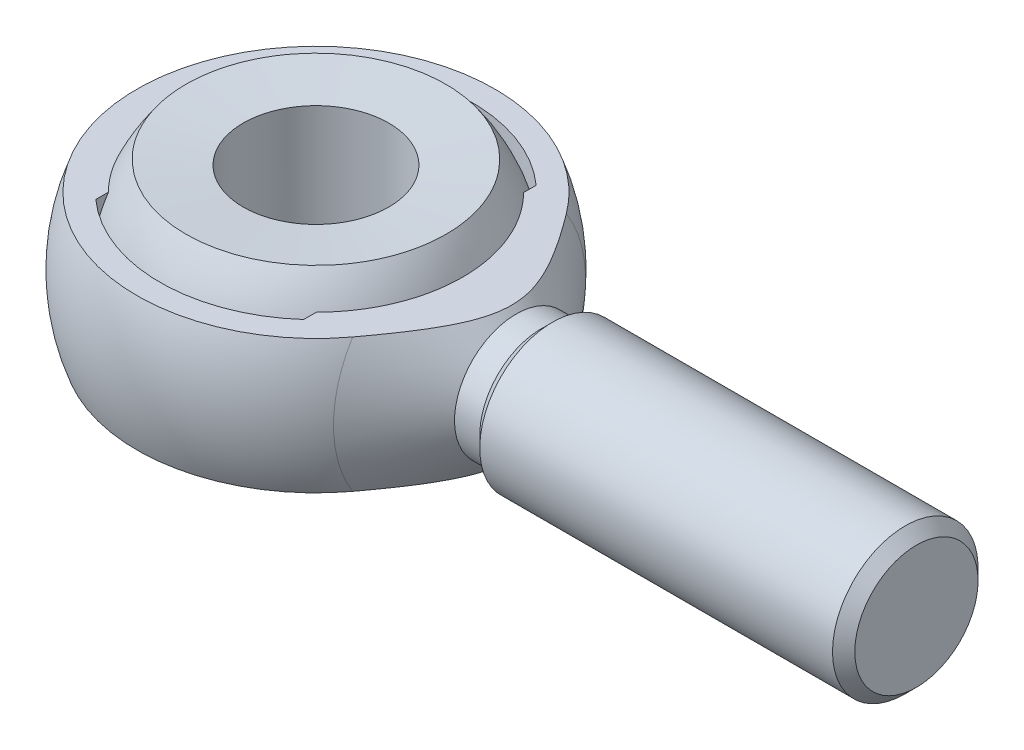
ISO-10303-21;
HEADER;
FILE_DESCRIPTION(('STEP AP214'),'2;1');
FILE_NAME('part.step','',(''),(''),'','','');
FILE_SCHEMA(('AUTOMOTIVE_DESIGN { 1 0 10303 214 1 1 1 1 }'));
ENDSEC;
DATA;
#1=APPLICATION_CONTEXT('core data for automotive mechanical design processes');
#2=APPLICATION_PROTOCOL_DEFINITION('international standard','automotive_design',2000,#1);
#3=PRODUCT_CONTEXT('',#1,'mechanical');
#4=PRODUCT('Part','Part','',(#3));
#5=PRODUCT_RELATED_PRODUCT_CATEGORY('part','',(#4));
#6=PRODUCT_DEFINITION_FORMATION('','',#4);
#7=PRODUCT_DEFINITION_CONTEXT('part definition',#1,'design');
#8=PRODUCT_DEFINITION('design','',#6,#7);
#9=PRODUCT_DEFINITION_SHAPE('','',#8);
#10=(LENGTH_UNIT() NAMED_UNIT(*) SI_UNIT(.MILLI.,.METRE.));
#11=(NAMED_UNIT(*) PLANE_ANGLE_UNIT() SI_UNIT($,.RADIAN.));
#12=(NAMED_UNIT(*) SI_UNIT($,.STERADIAN.) SOLID_ANGLE_UNIT());
#13=UNCERTAINTY_MEASURE_WITH_UNIT(LENGTH_MEASURE(1.E-05),#10,'distance_accuracy_value','');
#14=(GEOMETRIC_REPRESENTATION_CONTEXT(3) GLOBAL_UNCERTAINTY_ASSIGNED_CONTEXT((#13)) GLOBAL_UNIT_ASSIGNED_CONTEXT((#10,
#11,#12)) REPRESENTATION_CONTEXT('',''));
#15=CARTESIAN_POINT('',(0.,0.,0.));
#16=DIRECTION('',(0.,0.,1.));
#17=DIRECTION('',(1.,0.,0.));
#18=AXIS2_PLACEMENT_3D('',#15,#16,#17);
#19=CARTESIAN_POINT('',(0.,-11.0498662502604,0.));
#20=DIRECTION('',(0.,-1.,0.));
#21=DIRECTION('',(0.,0.,-1.));
#22=AXIS2_PLACEMENT_3D('',#19,#20,#21);
#23=CYLINDRICAL_SURFACE('',#22,7.999);
#24=CARTESIAN_POINT('',(0.,-9.95013374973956,0.));
#25=DIRECTION('',(0.,-1.,0.));
#26=DIRECTION('',(0.,0.,-1.));
#27=AXIS2_PLACEMENT_3D('',#24,#25,#26);
#28=CIRCLE('',#27,7.999);
#29=CARTESIAN_POINT('',(0.,-9.95013374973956,-7.999));
#30=VERTEX_POINT('',#29);
#31=EDGE_CURVE('E20',#30,#30,#28,.T.);
#32=ORIENTED_EDGE('',*,*,#31,.T.);
#33=EDGE_LOOP('',(#32));
#34=FACE_BOUND('',#33,.T.);
#35=CARTESIAN_POINT('',(0.,9.95013374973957,0.));
#36=DIRECTION('',(0.,-1.,0.));
#37=DIRECTION('',(0.,0.,-1.));
#38=AXIS2_PLACEMENT_3D('',#35,#36,#37);
#39=CIRCLE('',#38,7.999);
#40=CARTESIAN_POINT('',(0.,9.95013374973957,-7.999));
#41=VERTEX_POINT('',#40);
#42=EDGE_CURVE('E155',#41,#41,#39,.F.);
#43=ORIENTED_EDGE('',*,*,#42,.T.);
#44=EDGE_LOOP('',(#43));
#45=FACE_BOUND('',#44,.T.);
#46=ADVANCED_FACE('F16',(#34,#45),#23,.F.);
#47=CARTESIAN_POINT('',(8.,-9.95013374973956,0.));
#48=DIRECTION('',(0.,1.,0.));
#49=DIRECTION('',(0.,0.,1.));
#50=AXIS2_PLACEMENT_3D('',#47,#48,#49);
#51=PLANE('',#50);
#52=ORIENTED_EDGE('',*,*,#31,.F.);
#53=EDGE_LOOP('',(#52));
#54=FACE_BOUND('',#53,.T.);
#55=CARTESIAN_POINT('',(0.,-9.95013374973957,0.));
#56=DIRECTION('',(0.,-1.,0.));
#57=DIRECTION('',(0.,0.,-1.));
#58=AXIS2_PLACEMENT_3D('',#55,#56,#57);
#59=CIRCLE('',#58,8.);
#60=CARTESIAN_POINT('',(0.,-9.95013374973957,-8.));
#61=VERTEX_POINT('',#60);
#62=EDGE_CURVE('E153',#61,#61,#59,.T.);
#63=ORIENTED_EDGE('',*,*,#62,.T.);
#64=EDGE_LOOP('',(#63));
#65=FACE_BOUND('',#64,.T.);
#66=ADVANCED_FACE('F163',(#54,#65),#51,.F.);
#67=CARTESIAN_POINT('',(0.,9.95013374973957,0.));
#68=DIRECTION('',(0.,-1.,0.));
#69=DIRECTION('',(0.,0.,-1.));
#70=AXIS2_PLACEMENT_3D('',#67,#68,#69);
#71=PLANE('',#70);
#72=CARTESIAN_POINT('',(0.,9.95013374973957,0.));
#73=DIRECTION('',(0.,1.,0.));
#74=DIRECTION('',(0.,0.,1.));
#75=AXIS2_PLACEMENT_3D('',#72,#73,#74);
#76=CIRCLE('',#75,8.);
#77=CARTESIAN_POINT('',(0.,9.95013374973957,8.));
#78=VERTEX_POINT('',#77);
#79=EDGE_CURVE('E128',#78,#78,#76,.T.);
#80=ORIENTED_EDGE('',*,*,#79,.T.);
#81=EDGE_LOOP('',(#80));
#82=FACE_BOUND('',#81,.T.);
#83=ORIENTED_EDGE('',*,*,#42,.F.);
#84=EDGE_LOOP('',(#83));
#85=FACE_BOUND('',#84,.T.);
#86=ADVANCED_FACE('F166',(#82,#85),#71,.F.);
#87=CARTESIAN_POINT('',(0.,-10.5,0.));
#88=DIRECTION('',(0.,-1.,0.));
#89=DIRECTION('',(0.,0.,-1.));
#90=AXIS2_PLACEMENT_3D('',#87,#88,#89);
#91=CONICAL_SURFACE('',#90,14.285,1.48352986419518);
#92=ORIENTED_EDGE('',*,*,#62,.F.);
#93=EDGE_LOOP('',(#92));
#94=FACE_BOUND('',#93,.T.);
#95=CARTESIAN_POINT('',(0.,-10.5,0.));
#96=DIRECTION('',(0.,-1.,0.));
#97=DIRECTION('',(0.,0.,-1.));
#98=AXIS2_PLACEMENT_3D('',#95,#96,#97);
#99=CIRCLE('',#98,14.285);
#100=CARTESIAN_POINT('',(0.,-10.5,-14.285));
#101=VERTEX_POINT('',#100);
#102=EDGE_CURVE('E143',#101,#101,#99,.F.);
#103=ORIENTED_EDGE('',*,*,#102,.F.);
#104=EDGE_LOOP('',(#103));
#105=FACE_BOUND('',#104,.T.);
#106=ADVANCED_FACE('F170',(#94,#105),#91,.F.);
#107=CARTESIAN_POINT('',(11.428,21.,-5.71399999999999));
#108=DIRECTION('',(-1.,0.,0.));
#109=DIRECTION('',(0.,0.,1.));
#110=AXIS2_PLACEMENT_3D('',#107,#108,#109);
#111=PLANE('',#110);
#112=DIRECTION('',(0.,0.,1.));
#113=VECTOR('',#112,1.);
#114=CARTESIAN_POINT('',(11.428,-7.35,-5.71399999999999));
#115=LINE('',#114,#113);
#116=CARTESIAN_POINT('',(11.428,-7.35,-12.7768924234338));
#117=VERTEX_POINT('',#116);
#118=CARTESIAN_POINT('',(11.428,-7.35,-11.3881315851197));
#119=VERTEX_POINT('',#118);
#120=EDGE_CURVE('E133',#117,#119,#115,.T.);
#121=ORIENTED_EDGE('',*,*,#120,.T.);
#122=CARTESIAN_POINT('',(11.428,0.,0.));
#123=DIRECTION('',(-1.,0.,0.));
#124=DIRECTION('',(0.,0.,1.));
#125=AXIS2_PLACEMENT_3D('',#122,#123,#124);
#126=CIRCLE('',#125,13.5540415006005);
#127=CARTESIAN_POINT('',(11.428,-4.52361149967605,-12.7768924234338));
#128=VERTEX_POINT('',#127);
#129=EDGE_CURVE('E131',#128,#119,#126,.T.);
#130=ORIENTED_EDGE('',*,*,#129,.F.);
#131=DIRECTION('',(0.,1.,0.));
#132=VECTOR('',#131,1.);
#133=CARTESIAN_POINT('',(11.428,21.,-12.7768924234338));
#134=LINE('',#133,#132);
#135=EDGE_CURVE('E119',#128,#117,#134,.F.);
#136=ORIENTED_EDGE('',*,*,#135,.T.);
#137=EDGE_LOOP('',(#121,#130,#136));
#138=FACE_BOUND('',#137,.T.);
#139=ADVANCED_FACE('F132',(#138),#111,.T.);
#140=CARTESIAN_POINT('',(11.428,21.,12.7768924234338));
#141=DIRECTION('',(-1.,0.,0.));
#142=DIRECTION('',(0.,0.,1.));
#143=AXIS2_PLACEMENT_3D('',#140,#141,#142);
#144=PLANE('',#143);
#145=DIRECTION('',(0.,1.,0.));
#146=VECTOR('',#145,1.);
#147=CARTESIAN_POINT('',(11.428,21.,12.7768924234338));
#148=LINE('',#147,#146);
#149=CARTESIAN_POINT('',(11.428,-7.35,12.7768924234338));
#150=VERTEX_POINT('',#149);
#151=CARTESIAN_POINT('',(11.428,-4.523611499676,12.7768924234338));
#152=VERTEX_POINT('',#151);
#153=EDGE_CURVE('E146',#150,#152,#148,.T.);
#154=ORIENTED_EDGE('',*,*,#153,.T.);
#155=CARTESIAN_POINT('',(11.428,0.,0.));
#156=DIRECTION('',(-1.,0.,0.));
#157=DIRECTION('',(0.,0.,1.));
#158=AXIS2_PLACEMENT_3D('',#155,#156,#157);
#159=CIRCLE('',#158,13.5540415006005);
#160=CARTESIAN_POINT('',(11.428,-7.35,11.3881315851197));
#161=VERTEX_POINT('',#160);
#162=EDGE_CURVE('E137',#161,#152,#159,.T.);
#163=ORIENTED_EDGE('',*,*,#162,.F.);
#164=DIRECTION('',(0.,0.,1.));
#165=VECTOR('',#164,1.);
#166=CARTESIAN_POINT('',(11.428,-7.35,12.7768924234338));
#167=LINE('',#166,#165);
#168=EDGE_CURVE('E310',#161,#150,#167,.T.);
#169=ORIENTED_EDGE('',*,*,#168,.T.);
#170=EDGE_LOOP('',(#154,#163,#169));
#171=FACE_BOUND('',#170,.T.);
#172=ADVANCED_FACE('F309',(#171),#144,.T.);
#173=CARTESIAN_POINT('',(-11.428,21.,5.71399999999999));
#174=DIRECTION('',(1.,0.,0.));
#175=DIRECTION('',(0.,0.,-1.));
#176=AXIS2_PLACEMENT_3D('',#173,#174,#175);
#177=PLANE('',#176);
#178=DIRECTION('',(0.,0.,-1.));
#179=VECTOR('',#178,1.);
#180=CARTESIAN_POINT('',(-11.428,-7.35,5.71399999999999));
#181=LINE('',#180,#179);
#182=CARTESIAN_POINT('',(-11.428,-7.35,12.7768924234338));
#183=VERTEX_POINT('',#182);
#184=CARTESIAN_POINT('',(-11.428,-7.35,11.3881315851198));
#185=VERTEX_POINT('',#184);
#186=EDGE_CURVE('E330',#183,#185,#181,.T.);
#187=ORIENTED_EDGE('',*,*,#186,.T.);
#188=CARTESIAN_POINT('',(-11.428,0.,0.));
#189=DIRECTION('',(1.,0.,0.));
#190=DIRECTION('',(0.,0.,-1.));
#191=AXIS2_PLACEMENT_3D('',#188,#189,#190);
#192=CIRCLE('',#191,13.5540415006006);
#193=CARTESIAN_POINT('',(-11.428,-4.52361149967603,12.7768924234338));
#194=VERTEX_POINT('',#193);
#195=EDGE_CURVE('E300',#194,#185,#192,.T.);
#196=ORIENTED_EDGE('',*,*,#195,.F.);
#197=DIRECTION('',(0.,1.,0.));
#198=VECTOR('',#197,1.);
#199=CARTESIAN_POINT('',(-11.428,21.,12.7768924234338));
#200=LINE('',#199,#198);
#201=EDGE_CURVE('E312',#194,#183,#200,.F.);
#202=ORIENTED_EDGE('',*,*,#201,.T.);
#203=EDGE_LOOP('',(#187,#196,#202));
#204=FACE_BOUND('',#203,.T.);
#205=ADVANCED_FACE('F385',(#204),#177,.T.);
#206=CARTESIAN_POINT('',(-11.428,21.,-12.7768924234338));
#207=DIRECTION('',(1.,0.,0.));
#208=DIRECTION('',(0.,0.,-1.));
#209=AXIS2_PLACEMENT_3D('',#206,#207,#208);
#210=PLANE('',#209);
#211=DIRECTION('',(0.,1.,0.));
#212=VECTOR('',#211,1.);
#213=CARTESIAN_POINT('',(-11.428,21.,-12.7768924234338));
#214=LINE('',#213,#212);
#215=CARTESIAN_POINT('',(-11.428,-7.35,-12.7768924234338));
#216=VERTEX_POINT('',#215);
#217=CARTESIAN_POINT('',(-11.428,-4.52361149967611,-12.7768924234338));
#218=VERTEX_POINT('',#217);
#219=EDGE_CURVE('E113',#216,#218,#214,.T.);
#220=ORIENTED_EDGE('',*,*,#219,.T.);
#221=CARTESIAN_POINT('',(-11.428,0.,0.));
#222=DIRECTION('',(1.,0.,0.));
#223=DIRECTION('',(0.,0.,-1.));
#224=AXIS2_PLACEMENT_3D('',#221,#222,#223);
#225=CIRCLE('',#224,13.5540415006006);
#226=CARTESIAN_POINT('',(-11.428,-7.35,-11.3881315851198));
#227=VERTEX_POINT('',#226);
#228=EDGE_CURVE('E142',#227,#218,#225,.T.);
#229=ORIENTED_EDGE('',*,*,#228,.F.);
#230=DIRECTION('',(0.,0.,-1.));
#231=VECTOR('',#230,1.);
#232=CARTESIAN_POINT('',(-11.428,-7.35,-12.7768924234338));
#233=LINE('',#232,#231);
#234=EDGE_CURVE('E328',#227,#216,#233,.T.);
#235=ORIENTED_EDGE('',*,*,#234,.T.);
#236=EDGE_LOOP('',(#220,#229,#235));
#237=FACE_BOUND('',#236,.T.);
#238=ADVANCED_FACE('F378',(#237),#210,.T.);
#239=CARTESIAN_POINT('',(11.428,21.,12.7768924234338));
#240=DIRECTION('',(-1.,0.,0.));
#241=DIRECTION('',(0.,0.,1.));
#242=AXIS2_PLACEMENT_3D('',#239,#240,#241);
#243=PLANE('',#242);
#244=DIRECTION('',(0.,0.,1.));
#245=VECTOR('',#244,1.);
#246=CARTESIAN_POINT('',(11.428,7.35,12.7768924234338));
#247=LINE('',#246,#245);
#248=CARTESIAN_POINT('',(11.428,7.35,12.7768924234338));
#249=VERTEX_POINT('',#248);
#250=CARTESIAN_POINT('',(11.428,7.35,11.3881315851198));
#251=VERTEX_POINT('',#250);
#252=EDGE_CURVE('E326',#249,#251,#247,.F.);
#253=ORIENTED_EDGE('',*,*,#252,.T.);
#254=CARTESIAN_POINT('',(11.428,0.,0.));
#255=DIRECTION('',(-1.,0.,0.));
#256=DIRECTION('',(0.,0.,1.));
#257=AXIS2_PLACEMENT_3D('',#254,#255,#256);
#258=CIRCLE('',#257,13.5540415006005);
#259=CARTESIAN_POINT('',(11.428,4.52361149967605,12.7768924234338));
#260=VERTEX_POINT('',#259);
#261=EDGE_CURVE('E294',#260,#251,#258,.T.);
#262=ORIENTED_EDGE('',*,*,#261,.F.);
#263=DIRECTION('',(0.,1.,0.));
#264=VECTOR('',#263,1.);
#265=CARTESIAN_POINT('',(11.428,21.,12.7768924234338));
#266=LINE('',#265,#264);
#267=EDGE_CURVE('E353',#260,#249,#266,.T.);
#268=ORIENTED_EDGE('',*,*,#267,.T.);
#269=EDGE_LOOP('',(#253,#262,#268));
#270=FACE_BOUND('',#269,.T.);
#271=ADVANCED_FACE('F376',(#270),#243,.T.);
#272=CARTESIAN_POINT('',(11.428,21.,-5.71399999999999));
#273=DIRECTION('',(-1.,0.,0.));
#274=DIRECTION('',(0.,0.,1.));
#275=AXIS2_PLACEMENT_3D('',#272,#273,#274);
#276=PLANE('',#275);
#277=DIRECTION('',(0.,1.,0.));
#278=VECTOR('',#277,1.);
#279=CARTESIAN_POINT('',(11.428,21.,-12.7768924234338));
#280=LINE('',#279,#278);
#281=CARTESIAN_POINT('',(11.428,7.35,-12.7768924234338));
#282=VERTEX_POINT('',#281);
#283=CARTESIAN_POINT('',(11.428,4.52361149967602,-12.7768924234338));
#284=VERTEX_POINT('',#283);
#285=EDGE_CURVE('E317',#282,#284,#280,.F.);
#286=ORIENTED_EDGE('',*,*,#285,.T.);
#287=CARTESIAN_POINT('',(11.428,0.,0.));
#288=DIRECTION('',(-1.,0.,0.));
#289=DIRECTION('',(0.,0.,1.));
#290=AXIS2_PLACEMENT_3D('',#287,#288,#289);
#291=CIRCLE('',#290,13.5540415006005);
#292=CARTESIAN_POINT('',(11.428,7.35,-11.3881315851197));
#293=VERTEX_POINT('',#292);
#294=EDGE_CURVE('E291',#293,#284,#291,.T.);
#295=ORIENTED_EDGE('',*,*,#294,.F.);
#296=DIRECTION('',(0.,0.,1.));
#297=VECTOR('',#296,1.);
#298=CARTESIAN_POINT('',(11.428,7.35,-5.71399999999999));
#299=LINE('',#298,#297);
#300=EDGE_CURVE('E324',#293,#282,#299,.F.);
#301=ORIENTED_EDGE('',*,*,#300,.T.);
#302=EDGE_LOOP('',(#286,#295,#301));
#303=FACE_BOUND('',#302,.T.);
#304=ADVANCED_FACE('F363',(#303),#276,.T.);
#305=CARTESIAN_POINT('',(-11.428,21.,-12.7768924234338));
#306=DIRECTION('',(1.,0.,0.));
#307=DIRECTION('',(0.,0.,-1.));
#308=AXIS2_PLACEMENT_3D('',#305,#306,#307);
#309=PLANE('',#308);
#310=DIRECTION('',(0.,0.,-1.));
#311=VECTOR('',#310,1.);
#312=CARTESIAN_POINT('',(-11.428,7.35,-12.7768924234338));
#313=LINE('',#312,#311);
#314=CARTESIAN_POINT('',(-11.428,7.35,-12.7768924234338));
#315=VERTEX_POINT('',#314);
#316=CARTESIAN_POINT('',(-11.428,7.35,-11.3881315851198));
#317=VERTEX_POINT('',#316);
#318=EDGE_CURVE('E322',#315,#317,#313,.F.);
#319=ORIENTED_EDGE('',*,*,#318,.T.);
#320=CARTESIAN_POINT('',(-11.428,0.,0.));
#321=DIRECTION('',(1.,0.,0.));
#322=DIRECTION('',(0.,0.,-1.));
#323=AXIS2_PLACEMENT_3D('',#320,#321,#322);
#324=CIRCLE('',#323,13.5540415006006);
#325=CARTESIAN_POINT('',(-11.428,4.52361149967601,-12.7768924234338));
#326=VERTEX_POINT('',#325);
#327=EDGE_CURVE('E285',#326,#317,#324,.T.);
#328=ORIENTED_EDGE('',*,*,#327,.F.);
#329=DIRECTION('',(0.,1.,0.));
#330=VECTOR('',#329,1.);
#331=CARTESIAN_POINT('',(-11.428,21.,-12.7768924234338));
#332=LINE('',#331,#330);
#333=EDGE_CURVE('E299',#326,#315,#332,.T.);
#334=ORIENTED_EDGE('',*,*,#333,.T.);
#335=EDGE_LOOP('',(#319,#328,#334));
#336=FACE_BOUND('',#335,.T.);
#337=ADVANCED_FACE('F368',(#336),#309,.T.);
#338=CARTESIAN_POINT('',(-11.428,21.,5.71399999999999));
#339=DIRECTION('',(1.,0.,0.));
#340=DIRECTION('',(0.,0.,-1.));
#341=AXIS2_PLACEMENT_3D('',#338,#339,#340);
#342=PLANE('',#341);
#343=DIRECTION('',(0.,1.,0.));
#344=VECTOR('',#343,1.);
#345=CARTESIAN_POINT('',(-11.428,21.,12.7768924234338));
#346=LINE('',#345,#344);
#347=CARTESIAN_POINT('',(-11.428,7.35,12.7768924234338));
#348=VERTEX_POINT('',#347);
#349=CARTESIAN_POINT('',(-11.428,4.52361149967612,12.7768924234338));
#350=VERTEX_POINT('',#349);
#351=EDGE_CURVE('E297',#348,#350,#346,.F.);
#352=ORIENTED_EDGE('',*,*,#351,.T.);
#353=CARTESIAN_POINT('',(-11.428,0.,0.));
#354=DIRECTION('',(1.,0.,0.));
#355=DIRECTION('',(0.,0.,-1.));
#356=AXIS2_PLACEMENT_3D('',#353,#354,#355);
#357=CIRCLE('',#356,13.5540415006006);
#358=CARTESIAN_POINT('',(-11.428,7.35,11.3881315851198));
#359=VERTEX_POINT('',#358);
#360=EDGE_CURVE('E282',#359,#350,#357,.T.);
#361=ORIENTED_EDGE('',*,*,#360,.F.);
#362=DIRECTION('',(0.,0.,-1.));
#363=VECTOR('',#362,1.);
#364=CARTESIAN_POINT('',(-11.428,7.35,5.71399999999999));
#365=LINE('',#364,#363);
#366=EDGE_CURVE('E152',#359,#348,#365,.F.);
#367=ORIENTED_EDGE('',*,*,#366,.T.);
#368=EDGE_LOOP('',(#352,#361,#367));
#369=FACE_BOUND('',#368,.T.);
#370=ADVANCED_FACE('F371',(#369),#342,.T.);
#371=CARTESIAN_POINT('',(0.,10.5,0.));
#372=DIRECTION('',(0.,1.,0.));
#373=DIRECTION('',(0.,0.,1.));
#374=AXIS2_PLACEMENT_3D('',#371,#372,#373);
#375=CONICAL_SURFACE('',#374,14.285,1.48352986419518);
#376=ORIENTED_EDGE('',*,*,#79,.F.);
#377=EDGE_LOOP('',(#376));
#378=FACE_BOUND('',#377,.T.);
#379=CARTESIAN_POINT('',(0.,10.5,0.));
#380=DIRECTION('',(0.,1.,0.));
#381=DIRECTION('',(0.,0.,1.));
#382=AXIS2_PLACEMENT_3D('',#379,#380,#381);
#383=CIRCLE('',#382,14.285);
#384=CARTESIAN_POINT('',(0.,10.5,14.285));
#385=VERTEX_POINT('',#384);
#386=EDGE_CURVE('E276',#385,#385,#383,.F.);
#387=ORIENTED_EDGE('',*,*,#386,.F.);
#388=EDGE_LOOP('',(#387));
#389=FACE_BOUND('',#388,.T.);
#390=ADVANCED_FACE('F465',(#378,#389),#375,.F.);
#391=CARTESIAN_POINT('',(0.,21.,0.));
#392=DIRECTION('',(0.,1.,0.));
#393=DIRECTION('',(0.,0.,1.));
#394=AXIS2_PLACEMENT_3D('',#391,#392,#393);
#395=CYLINDRICAL_SURFACE('',#394,17.142);
#396=CARTESIAN_POINT('',(0.,-7.35,0.));
#397=DIRECTION('',(0.,1.,0.));
#398=DIRECTION('',(0.,0.,1.));
#399=AXIS2_PLACEMENT_3D('',#396,#397,#398);
#400=CIRCLE('',#399,17.142);
#401=EDGE_CURVE('E126',#117,#216,#400,.T.);
#402=ORIENTED_EDGE('',*,*,#401,.F.);
#403=ORIENTED_EDGE('',*,*,#135,.F.);
#404=CARTESIAN_POINT('',(0.,-4.52361149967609,0.));
#405=DIRECTION('',(0.,1.,0.));
#406=DIRECTION('',(0.,0.,1.));
#407=AXIS2_PLACEMENT_3D('',#404,#405,#406);
#408=CIRCLE('',#407,17.142);
#409=EDGE_CURVE('E123',#218,#128,#408,.F.);
#410=ORIENTED_EDGE('',*,*,#409,.F.);
#411=ORIENTED_EDGE('',*,*,#219,.F.);
#412=EDGE_LOOP('',(#402,#403,#410,#411));
#413=FACE_BOUND('',#412,.T.);
#414=ADVANCED_FACE('F121',(#413),#395,.F.);
#415=CARTESIAN_POINT('',(0.,21.,0.));
#416=DIRECTION('',(0.,1.,0.));
#417=DIRECTION('',(0.,0.,1.));
#418=AXIS2_PLACEMENT_3D('',#415,#416,#417);
#419=CYLINDRICAL_SURFACE('',#418,17.142);
#420=CARTESIAN_POINT('',(0.,-7.35,0.));
#421=DIRECTION('',(0.,1.,0.));
#422=DIRECTION('',(0.,0.,1.));
#423=AXIS2_PLACEMENT_3D('',#420,#421,#422);
#424=CIRCLE('',#423,17.142);
#425=EDGE_CURVE('E269',#183,#150,#424,.T.);
#426=ORIENTED_EDGE('',*,*,#425,.F.);
#427=ORIENTED_EDGE('',*,*,#201,.F.);
#428=CARTESIAN_POINT('',(0.,-4.52361149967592,0.));
#429=DIRECTION('',(0.,1.,0.));
#430=DIRECTION('',(0.,0.,1.));
#431=AXIS2_PLACEMENT_3D('',#428,#429,#430);
#432=CIRCLE('',#431,17.142);
#433=EDGE_CURVE('E303',#152,#194,#432,.F.);
#434=ORIENTED_EDGE('',*,*,#433,.F.);
#435=ORIENTED_EDGE('',*,*,#153,.F.);
#436=EDGE_LOOP('',(#426,#427,#434,#435));
#437=FACE_BOUND('',#436,.T.);
#438=ADVANCED_FACE('F177',(#437),#419,.F.);
#439=CARTESIAN_POINT('',(0.,0.,0.));
#440=DIRECTION('',(1.,0.,0.));
#441=DIRECTION('',(0.,-0.238227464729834,0.971209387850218));
#442=AXIS2_PLACEMENT_3D('',#439,#440,#441);
#443=SPHERICAL_SURFACE('',#442,17.7288246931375);
#444=CARTESIAN_POINT('',(0.,-7.35,0.));
#445=DIRECTION('',(0.,-1.,0.));
#446=DIRECTION('',(1.,0.,0.));
#447=AXIS2_PLACEMENT_3D('',#444,#445,#446);
#448=CIRCLE('',#447,16.1334659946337);
#449=EDGE_CURVE('E272',#227,#185,#448,.F.);
#450=ORIENTED_EDGE('',*,*,#449,.F.);
#451=ORIENTED_EDGE('',*,*,#228,.T.);
#452=ORIENTED_EDGE('',*,*,#409,.T.);
#453=ORIENTED_EDGE('',*,*,#129,.T.);
#454=CARTESIAN_POINT('',(0.,-7.35,0.));
#455=DIRECTION('',(0.,-1.,0.));
#456=DIRECTION('',(1.,0.,0.));
#457=AXIS2_PLACEMENT_3D('',#454,#455,#456);
#458=CIRCLE('',#457,16.1334659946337);
#459=EDGE_CURVE('E267',#161,#119,#458,.F.);
#460=ORIENTED_EDGE('',*,*,#459,.F.);
#461=ORIENTED_EDGE('',*,*,#162,.T.);
#462=ORIENTED_EDGE('',*,*,#433,.T.);
#463=ORIENTED_EDGE('',*,*,#195,.T.);
#464=EDGE_LOOP('',(#450,#451,#452,#453,#460,#461,#462,#463));
#465=FACE_BOUND('',#464,.T.);
#466=ORIENTED_EDGE('',*,*,#102,.T.);
#467=EDGE_LOOP('',(#466));
#468=FACE_BOUND('',#467,.T.);
#469=ADVANCED_FACE('F140',(#465,#468),#443,.T.);
#470=CARTESIAN_POINT('',(0.,21.,0.));
#471=DIRECTION('',(0.,1.,0.));
#472=DIRECTION('',(0.,0.,1.));
#473=AXIS2_PLACEMENT_3D('',#470,#471,#472);
#474=CYLINDRICAL_SURFACE('',#473,17.142);
#475=CARTESIAN_POINT('',(0.,7.35,0.));
#476=DIRECTION('',(0.,1.,0.));
#477=DIRECTION('',(0.,0.,1.));
#478=AXIS2_PLACEMENT_3D('',#475,#476,#477);
#479=CIRCLE('',#478,17.142);
#480=EDGE_CURVE('E264',#315,#282,#479,.F.);
#481=ORIENTED_EDGE('',*,*,#480,.F.);
#482=ORIENTED_EDGE('',*,*,#333,.F.);
#483=CARTESIAN_POINT('',(0.,4.52361149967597,0.));
#484=DIRECTION('',(0.,1.,0.));
#485=DIRECTION('',(0.,0.,1.));
#486=AXIS2_PLACEMENT_3D('',#483,#484,#485);
#487=CIRCLE('',#486,17.142);
#488=EDGE_CURVE('E288',#284,#326,#487,.T.);
#489=ORIENTED_EDGE('',*,*,#488,.F.);
#490=ORIENTED_EDGE('',*,*,#285,.F.);
#491=EDGE_LOOP('',(#481,#482,#489,#490));
#492=FACE_BOUND('',#491,.T.);
#493=ADVANCED_FACE('F176',(#492),#474,.F.);
#494=CARTESIAN_POINT('',(0.,21.,0.));
#495=DIRECTION('',(0.,1.,0.));
#496=DIRECTION('',(0.,0.,1.));
#497=AXIS2_PLACEMENT_3D('',#494,#495,#496);
#498=CYLINDRICAL_SURFACE('',#497,17.142);
#499=CARTESIAN_POINT('',(0.,4.523611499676,0.));
#500=DIRECTION('',(0.,1.,0.));
#501=DIRECTION('',(0.,0.,1.));
#502=AXIS2_PLACEMENT_3D('',#499,#500,#501);
#503=CIRCLE('',#502,17.142);
#504=EDGE_CURVE('E279',#350,#260,#503,.T.);
#505=ORIENTED_EDGE('',*,*,#504,.F.);
#506=ORIENTED_EDGE('',*,*,#351,.F.);
#507=CARTESIAN_POINT('',(0.,7.35,0.));
#508=DIRECTION('',(0.,1.,0.));
#509=DIRECTION('',(0.,0.,1.));
#510=AXIS2_PLACEMENT_3D('',#507,#508,#509);
#511=CIRCLE('',#510,17.142);
#512=EDGE_CURVE('E258',#249,#348,#511,.F.);
#513=ORIENTED_EDGE('',*,*,#512,.F.);
#514=ORIENTED_EDGE('',*,*,#267,.F.);
#515=EDGE_LOOP('',(#505,#506,#513,#514));
#516=FACE_BOUND('',#515,.T.);
#517=ADVANCED_FACE('F184',(#516),#498,.F.);
#518=CARTESIAN_POINT('',(0.,0.,0.));
#519=DIRECTION('',(1.,0.,0.));
#520=DIRECTION('',(0.,0.238227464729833,-0.971209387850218));
#521=AXIS2_PLACEMENT_3D('',#518,#519,#520);
#522=SPHERICAL_SURFACE('',#521,17.7288246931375);
#523=ORIENTED_EDGE('',*,*,#386,.T.);
#524=EDGE_LOOP('',(#523));
#525=FACE_BOUND('',#524,.T.);
#526=ORIENTED_EDGE('',*,*,#360,.T.);
#527=ORIENTED_EDGE('',*,*,#504,.T.);
#528=ORIENTED_EDGE('',*,*,#261,.T.);
#529=CARTESIAN_POINT('',(0.,7.35,0.));
#530=DIRECTION('',(0.,1.,0.));
#531=DIRECTION('',(0.,0.,1.));
#532=AXIS2_PLACEMENT_3D('',#529,#530,#531);
#533=CIRCLE('',#532,16.1334659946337);
#534=EDGE_CURVE('E261',#293,#251,#533,.F.);
#535=ORIENTED_EDGE('',*,*,#534,.F.);
#536=ORIENTED_EDGE('',*,*,#294,.T.);
#537=ORIENTED_EDGE('',*,*,#488,.T.);
#538=ORIENTED_EDGE('',*,*,#327,.T.);
#539=CARTESIAN_POINT('',(0.,7.35,0.));
#540=DIRECTION('',(0.,1.,0.));
#541=DIRECTION('',(0.,0.,1.));
#542=AXIS2_PLACEMENT_3D('',#539,#540,#541);
#543=CIRCLE('',#542,16.1334659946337);
#544=EDGE_CURVE('E255',#359,#317,#543,.F.);
#545=ORIENTED_EDGE('',*,*,#544,.F.);
#546=EDGE_LOOP('',(#526,#527,#528,#535,#536,#537,#538,#545));
#547=FACE_BOUND('',#546,.T.);
#548=ADVANCED_FACE('F243',(#525,#547),#522,.T.);
#549=CARTESIAN_POINT('',(22.01,-7.35,21.));
#550=DIRECTION('',(0.,-1.,0.));
#551=DIRECTION('',(1.,0.,0.));
#552=AXIS2_PLACEMENT_3D('',#549,#550,#551);
#553=PLANE('',#552);
#554=ORIENTED_EDGE('',*,*,#459,.T.);
#555=ORIENTED_EDGE('',*,*,#120,.F.);
#556=ORIENTED_EDGE('',*,*,#401,.T.);
#557=ORIENTED_EDGE('',*,*,#234,.F.);
#558=ORIENTED_EDGE('',*,*,#449,.T.);
#559=ORIENTED_EDGE('',*,*,#186,.F.);
#560=ORIENTED_EDGE('',*,*,#425,.T.);
#561=ORIENTED_EDGE('',*,*,#168,.F.);
#562=EDGE_LOOP('',(#554,#555,#556,#557,#558,#559,#560,#561));
#563=FACE_BOUND('',#562,.T.);
#564=CARTESIAN_POINT('',(0.,-7.35,0.));
#565=DIRECTION('',(0.,-1.,0.));
#566=DIRECTION('',(1.,0.,0.));
#567=AXIS2_PLACEMENT_3D('',#564,#565,#566);
#568=CIRCLE('',#567,19.671743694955);
#569=CARTESIAN_POINT('',(15.779482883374,-7.35,-11.7467195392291));
#570=VERTEX_POINT('',#569);
#571=CARTESIAN_POINT('',(15.779482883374,-7.35,11.7467195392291));
#572=VERTEX_POINT('',#571);
#573=EDGE_CURVE('E251',#570,#572,#568,.F.);
#574=ORIENTED_EDGE('',*,*,#573,.F.);
#575=CARTESIAN_POINT('',(15.779482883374,-7.35,11.7467195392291));
#576=CARTESIAN_POINT('',(15.927491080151,-7.35,11.5478862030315));
#577=CARTESIAN_POINT('',(16.074831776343,-7.35,11.3485533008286));
#578=CARTESIAN_POINT('',(16.3679612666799,-7.35,10.9487405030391));
#579=CARTESIAN_POINT('',(16.5137500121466,-7.35,10.7482605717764));
#580=CARTESIAN_POINT('',(16.8036528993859,-7.35,10.3458746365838));
#581=CARTESIAN_POINT('',(16.9477657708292,-7.35,10.1439677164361));
#582=CARTESIAN_POINT('',(17.2339314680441,-7.35,9.73870018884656));
#583=CARTESIAN_POINT('',(17.3759843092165,-7.35,9.53533959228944));
#584=CARTESIAN_POINT('',(17.6616676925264,-7.35,9.12121114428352));
#585=CARTESIAN_POINT('',(17.8052298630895,-7.35,8.91039606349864));
#586=CARTESIAN_POINT('',(18.0893798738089,-7.35,8.48677116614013));
#587=CARTESIAN_POINT('',(18.2299677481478,-7.35,8.27396137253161));
#588=CARTESIAN_POINT('',(18.5075897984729,-7.35,7.84610340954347));
#589=CARTESIAN_POINT('',(18.6446248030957,-7.35,7.63105577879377));
#590=CARTESIAN_POINT('',(18.9144938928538,-7.35,7.1983375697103));
#591=CARTESIAN_POINT('',(19.0473280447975,-7.35,6.98066703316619));
#592=CARTESIAN_POINT('',(19.2861092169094,-7.35,6.57903521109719));
#593=CARTESIAN_POINT('',(19.3928324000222,-7.35,6.39553598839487));
#594=CARTESIAN_POINT('',(19.6021635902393,-7.35,6.02620737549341));
#595=CARTESIAN_POINT('',(19.7047717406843,-7.35,5.84037806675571));
#596=CARTESIAN_POINT('',(19.9051980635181,-7.35,5.46601502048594));
#597=CARTESIAN_POINT('',(20.0030135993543,-7.35,5.27747986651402));
#598=CARTESIAN_POINT('',(20.1928982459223,-7.35,4.89754911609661));
#599=CARTESIAN_POINT('',(20.2849678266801,-7.35,4.70615375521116));
#600=CARTESIAN_POINT('',(20.4614869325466,-7.35,4.32199904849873));
#601=CARTESIAN_POINT('',(20.5459991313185,-7.35,4.12926875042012));
#602=CARTESIAN_POINT('',(20.7071150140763,-7.35,3.74054526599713));
#603=CARTESIAN_POINT('',(20.7837182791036,-7.35,3.54455190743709));
#604=CARTESIAN_POINT('',(20.9994279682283,-7.35,2.95176200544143));
#605=CARTESIAN_POINT('',(21.1246810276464,-7.35,2.54963581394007));
#606=CARTESIAN_POINT('',(21.2875750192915,-7.35,1.88646069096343));
#607=CARTESIAN_POINT('',(21.3404535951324,-7.35,1.62913707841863));
#608=CARTESIAN_POINT('',(21.4238385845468,-7.35,1.11084975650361));
#609=CARTESIAN_POINT('',(21.4543493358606,-7.35,0.849886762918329));
#610=CARTESIAN_POINT('',(21.4909675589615,-7.35,0.326974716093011));
#611=CARTESIAN_POINT('',(21.4971443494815,-7.35,0.0650305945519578));
#612=CARTESIAN_POINT('',(21.4848565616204,-7.35,-0.458287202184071));
#613=CARTESIAN_POINT('',(21.4663903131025,-7.35,-0.71966083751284));
#614=CARTESIAN_POINT('',(21.4063554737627,-7.35,-1.23718953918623));
#615=CARTESIAN_POINT('',(21.3650062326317,-7.35,-1.49337057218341));
#616=CARTESIAN_POINT('',(21.2617997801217,-7.35,-2.0015259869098));
#617=CARTESIAN_POINT('',(21.1999403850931,-7.35,-2.25349991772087));
#618=CARTESIAN_POINT('',(21.0579065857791,-7.35,-2.75526865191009));
#619=CARTESIAN_POINT('',(20.9775314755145,-7.35,-3.00500588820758));
#620=CARTESIAN_POINT('',(20.8019687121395,-7.35,-3.4991064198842));
#621=CARTESIAN_POINT('',(20.7067834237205,-7.35,-3.74347056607));
#622=CARTESIAN_POINT('',(20.4537994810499,-7.35,-4.34790875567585));
#623=CARTESIAN_POINT('',(20.2884723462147,-7.35,-4.7048183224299));
#624=CARTESIAN_POINT('',(19.9380348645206,-7.35,-5.40886855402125));
#625=CARTESIAN_POINT('',(19.7529129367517,-7.35,-5.75600334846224));
#626=CARTESIAN_POINT('',(19.3675654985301,-7.35,-6.44317546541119));
#627=CARTESIAN_POINT('',(19.1672938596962,-7.35,-6.78318672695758));
#628=CARTESIAN_POINT('',(18.7559320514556,-7.35,-7.45645095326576));
#629=CARTESIAN_POINT('',(18.5448442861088,-7.35,-7.78970539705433));
#630=CARTESIAN_POINT('',(18.12726397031,-7.35,-8.43108993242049));
#631=CARTESIAN_POINT('',(17.9212490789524,-7.35,-8.7395324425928));
#632=CARTESIAN_POINT('',(17.5034706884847,-7.35,-9.35252210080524));
#633=CARTESIAN_POINT('',(17.2917067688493,-7.35,-9.65706896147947));
#634=CARTESIAN_POINT('',(16.8652279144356,-7.35,-10.2606568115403));
#635=CARTESIAN_POINT('',(16.6505470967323,-7.35,-10.5597219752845));
#636=CARTESIAN_POINT('',(16.2175485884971,-7.35,-11.155124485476));
#637=CARTESIAN_POINT('',(15.9992315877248,-7.35,-11.4514623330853));
#638=CARTESIAN_POINT('',(15.779482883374,-7.35,-11.7467195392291));
#639=B_SPLINE_CURVE_WITH_KNOTS('',3,(#575,#576,#577,#578,#579,#580,#581,#582,#583,#584,#585,
#586,#587,#588,#589,#590,#591,#592,#593,#594,#595,#596,#597,#598,#599,#600,#601,#602,#603,#604,
#605,#606,#607,#608,#609,#610,#611,#612,#613,#614,#615,#616,#617,#618,#619,#620,#621,#622,#623,
#624,#625,#626,#627,#628,#629,#630,#631,#632,#633,#634,#635,#636,#637,#638),.UNSPECIFIED.,.F.,
.F.,(4,2,2,2,2,2,2,2,2,2,2,2,2,2,2,2,2,2,2,2,2,2,2,2,2,2,2,2,2,2,2,4),(0.,0.743621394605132,
1.48726604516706,2.23144179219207,2.97561197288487,3.74075579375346,4.50589081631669,
5.27084575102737,6.03578851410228,6.67257716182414,7.30934360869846,7.94645651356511,
8.58351723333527,9.21467804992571,9.84587228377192,11.1065397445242,11.8938270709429,
12.6809616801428,13.4658523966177,14.2507963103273,15.0283431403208,15.8059727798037,
16.5924652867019,17.3788323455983,18.5579447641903,19.7377508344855,20.9213062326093,
22.1045996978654,23.2172702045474,24.3300223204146,25.4344155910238,26.5386016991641),.UNSPECIFIED.);
#640=EDGE_CURVE('E245',#572,#570,#639,.T.);
#641=ORIENTED_EDGE('',*,*,#640,.F.);
#642=EDGE_LOOP('',(#574,#641));
#643=FACE_BOUND('',#642,.T.);
#644=ADVANCED_FACE('F238',(#563,#643),#553,.T.);
#645=CARTESIAN_POINT('',(-42.,7.35,21.));
#646=DIRECTION('',(0.,1.,0.));
#647=DIRECTION('',(0.,0.,1.));
#648=AXIS2_PLACEMENT_3D('',#645,#646,#647);
#649=PLANE('',#648);
#650=ORIENTED_EDGE('',*,*,#366,.F.);
#651=ORIENTED_EDGE('',*,*,#544,.T.);
#652=ORIENTED_EDGE('',*,*,#318,.F.);
#653=ORIENTED_EDGE('',*,*,#480,.T.);
#654=ORIENTED_EDGE('',*,*,#300,.F.);
#655=ORIENTED_EDGE('',*,*,#534,.T.);
#656=ORIENTED_EDGE('',*,*,#252,.F.);
#657=ORIENTED_EDGE('',*,*,#512,.T.);
#658=EDGE_LOOP('',(#650,#651,#652,#653,#654,#655,#656,#657));
#659=FACE_BOUND('',#658,.T.);
#660=CARTESIAN_POINT('',(15.779482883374,7.35,-11.7467195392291));
#661=CARTESIAN_POINT('',(15.927491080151,7.35,-11.5478862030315));
#662=CARTESIAN_POINT('',(16.074831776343,7.35,-11.3485533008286));
#663=CARTESIAN_POINT('',(16.3679612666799,7.35,-10.9487405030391));
#664=CARTESIAN_POINT('',(16.5137500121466,7.35,-10.7482605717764));
#665=CARTESIAN_POINT('',(16.8036528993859,7.35,-10.3458746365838));
#666=CARTESIAN_POINT('',(16.9477657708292,7.35,-10.1439677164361));
#667=CARTESIAN_POINT('',(17.2339314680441,7.35,-9.73870018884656));
#668=CARTESIAN_POINT('',(17.3759843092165,7.35,-9.53533959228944));
#669=CARTESIAN_POINT('',(17.6616676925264,7.35,-9.12121114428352));
#670=CARTESIAN_POINT('',(17.8052298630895,7.35,-8.91039606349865));
#671=CARTESIAN_POINT('',(18.0893798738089,7.35,-8.48677116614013));
#672=CARTESIAN_POINT('',(18.2299677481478,7.35,-8.27396137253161));
#673=CARTESIAN_POINT('',(18.5075897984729,7.35,-7.84610340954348));
#674=CARTESIAN_POINT('',(18.6446248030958,7.35,-7.63105577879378));
#675=CARTESIAN_POINT('',(18.9144938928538,7.35,-7.19833756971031));
#676=CARTESIAN_POINT('',(19.0473280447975,7.35,-6.9806670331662));
#677=CARTESIAN_POINT('',(19.2861092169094,7.35,-6.5790352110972));
#678=CARTESIAN_POINT('',(19.3928324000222,7.35,-6.39553598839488));
#679=CARTESIAN_POINT('',(19.6021635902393,7.35,-6.02620737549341));
#680=CARTESIAN_POINT('',(19.7047717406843,7.35,-5.84037806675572));
#681=CARTESIAN_POINT('',(19.9051980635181,7.35,-5.46601502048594));
#682=CARTESIAN_POINT('',(20.0030135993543,7.35,-5.27747986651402));
#683=CARTESIAN_POINT('',(20.1928982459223,7.35,-4.89754911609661));
#684=CARTESIAN_POINT('',(20.2849678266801,7.35,-4.70615375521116));
#685=CARTESIAN_POINT('',(20.4614869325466,7.35,-4.32199904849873));
#686=CARTESIAN_POINT('',(20.5459991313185,7.35,-4.12926875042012));
#687=CARTESIAN_POINT('',(20.7071150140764,7.35,-3.74054526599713));
#688=CARTESIAN_POINT('',(20.7837182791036,7.35,-3.54455190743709));
#689=CARTESIAN_POINT('',(20.9994279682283,7.35,-2.95176200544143));
#690=CARTESIAN_POINT('',(21.1246810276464,7.35,-2.54963581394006));
#691=CARTESIAN_POINT('',(21.2875750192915,7.35,-1.88646069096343));
#692=CARTESIAN_POINT('',(21.3404535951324,7.35,-1.62913707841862));
#693=CARTESIAN_POINT('',(21.4238385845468,7.35,-1.11084975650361));
#694=CARTESIAN_POINT('',(21.4543493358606,7.35,-0.849886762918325));
#695=CARTESIAN_POINT('',(21.4909675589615,7.35,-0.326974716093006));
#696=CARTESIAN_POINT('',(21.4971443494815,7.35,-0.0650305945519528));
#697=CARTESIAN_POINT('',(21.4848565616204,7.35,0.458287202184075));
#698=CARTESIAN_POINT('',(21.4663903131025,7.35,0.719660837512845));
#699=CARTESIAN_POINT('',(21.4063554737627,7.35,1.23718953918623));
#700=CARTESIAN_POINT('',(21.3650062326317,7.35,1.49337057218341));
#701=CARTESIAN_POINT('',(21.2617997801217,7.35,2.00152598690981));
#702=CARTESIAN_POINT('',(21.1999403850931,7.35,2.25349991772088));
#703=CARTESIAN_POINT('',(21.0579065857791,7.35,2.75526865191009));
#704=CARTESIAN_POINT('',(20.9775314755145,7.35,3.00500588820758));
#705=CARTESIAN_POINT('',(20.8019687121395,7.35,3.4991064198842));
#706=CARTESIAN_POINT('',(20.7067834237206,7.35,3.74347056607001));
#707=CARTESIAN_POINT('',(20.4537994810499,7.35,4.34790875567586));
#708=CARTESIAN_POINT('',(20.2884723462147,7.35,4.7048183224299));
#709=CARTESIAN_POINT('',(19.9380348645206,7.35,5.40886855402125));
#710=CARTESIAN_POINT('',(19.7529129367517,7.35,5.75600334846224));
#711=CARTESIAN_POINT('',(19.3675654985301,7.35,6.44317546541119));
#712=CARTESIAN_POINT('',(19.1672938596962,7.35,6.78318672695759));
#713=CARTESIAN_POINT('',(18.7559320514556,7.35,7.45645095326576));
#714=CARTESIAN_POINT('',(18.5448442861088,7.35,7.78970539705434));
#715=CARTESIAN_POINT('',(18.12726397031,7.35,8.43108993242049));
#716=CARTESIAN_POINT('',(17.9212490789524,7.35,8.7395324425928));
#717=CARTESIAN_POINT('',(17.5034706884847,7.35,9.35252210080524));
#718=CARTESIAN_POINT('',(17.2917067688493,7.35,9.65706896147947));
#719=CARTESIAN_POINT('',(16.8652279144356,7.35,10.2606568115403));
#720=CARTESIAN_POINT('',(16.6505470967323,7.35,10.5597219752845));
#721=CARTESIAN_POINT('',(16.2175485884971,7.35,11.155124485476));
#722=CARTESIAN_POINT('',(15.9992315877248,7.35,11.4514623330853));
#723=CARTESIAN_POINT('',(15.779482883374,7.35,11.7467195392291));
#724=B_SPLINE_CURVE_WITH_KNOTS('',3,(#660,#661,#662,#663,#664,#665,#666,#667,#668,#669,#670,
#671,#672,#673,#674,#675,#676,#677,#678,#679,#680,#681,#682,#683,#684,#685,#686,#687,#688,#689,
#690,#691,#692,#693,#694,#695,#696,#697,#698,#699,#700,#701,#702,#703,#704,#705,#706,#707,#708,
#709,#710,#711,#712,#713,#714,#715,#716,#717,#718,#719,#720,#721,#722,#723),.UNSPECIFIED.,.F.,
.F.,(4,2,2,2,2,2,2,2,2,2,2,2,2,2,2,2,2,2,2,2,2,2,2,2,2,2,2,2,2,2,2,4),(0.,0.743621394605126,
1.48726604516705,2.23144179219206,2.97561197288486,3.74075579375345,4.50589081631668,
5.27084575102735,6.03578851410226,6.67257716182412,7.30934360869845,7.9464565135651,
8.58351723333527,9.2146780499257,9.84587228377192,11.1065397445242,11.8938270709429,
12.6809616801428,13.4658523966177,14.2507963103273,15.0283431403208,15.8059727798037,
16.5924652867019,17.3788323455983,18.5579447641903,19.7377508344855,20.9213062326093,
22.1045996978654,23.2172702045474,24.3300223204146,25.4344155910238,26.5386016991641),.UNSPECIFIED.);
#725=CARTESIAN_POINT('',(15.779482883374,7.35,-11.7467195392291));
#726=VERTEX_POINT('',#725);
#727=CARTESIAN_POINT('',(15.779482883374,7.35,11.7467195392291));
#728=VERTEX_POINT('',#727);
#729=EDGE_CURVE('E223',#726,#728,#724,.T.);
#730=ORIENTED_EDGE('',*,*,#729,.F.);
#731=CARTESIAN_POINT('',(0.,7.35,0.));
#732=DIRECTION('',(0.,1.,0.));
#733=DIRECTION('',(0.,0.,1.));
#734=AXIS2_PLACEMENT_3D('',#731,#732,#733);
#735=CIRCLE('',#734,19.671743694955);
#736=EDGE_CURVE('E34',#728,#726,#735,.F.);
#737=ORIENTED_EDGE('',*,*,#736,.F.);
#738=EDGE_LOOP('',(#730,#737));
#739=FACE_BOUND('',#738,.T.);
#740=ADVANCED_FACE('F234',(#659,#739),#649,.T.);
#741=CARTESIAN_POINT('',(0.,0.,0.));
#742=DIRECTION('',(0.,1.,0.));
#743=DIRECTION('',(0.,0.,1.));
#744=AXIS2_PLACEMENT_3D('',#741,#742,#743);
#745=SPHERICAL_SURFACE('',#744,21.);
#746=ORIENTED_EDGE('',*,*,#573,.T.);
#747=CARTESIAN_POINT('',(15.779482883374,0.,0.));
#748=DIRECTION('',(-1.,0.,0.));
#749=DIRECTION('',(0.,0.,1.));
#750=AXIS2_PLACEMENT_3D('',#747,#748,#749);
#751=CIRCLE('',#750,13.8566922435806);
#752=EDGE_CURVE('E230',#728,#572,#751,.F.);
#753=ORIENTED_EDGE('',*,*,#752,.F.);
#754=ORIENTED_EDGE('',*,*,#736,.T.);
#755=CARTESIAN_POINT('',(15.779482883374,0.,0.));
#756=DIRECTION('',(-1.,0.,0.));
#757=DIRECTION('',(0.,0.,1.));
#758=AXIS2_PLACEMENT_3D('',#755,#756,#757);
#759=CIRCLE('',#758,13.8566922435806);
#760=EDGE_CURVE('E231',#570,#726,#759,.F.);
#761=ORIENTED_EDGE('',*,*,#760,.F.);
#762=EDGE_LOOP('',(#746,#753,#754,#761));
#763=FACE_BOUND('',#762,.T.);
#764=ADVANCED_FACE('F18',(#763),#745,.T.);
#765=CARTESIAN_POINT('',(15.779482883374,0.,0.));
#766=DIRECTION('',(-1.,0.,0.));
#767=DIRECTION('',(0.,0.,1.));
#768=AXIS2_PLACEMENT_3D('',#765,#766,#767);
#769=CONICAL_SURFACE('',#768,13.8566922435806,0.850187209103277);
#770=ORIENTED_EDGE('',*,*,#640,.T.);
#771=ORIENTED_EDGE('',*,*,#760,.T.);
#772=ORIENTED_EDGE('',*,*,#729,.T.);
#773=ORIENTED_EDGE('',*,*,#752,.T.);
#774=EDGE_LOOP('',(#770,#771,#772,#773));
#775=FACE_BOUND('',#774,.T.);
#776=CARTESIAN_POINT('',(22.,0.,0.));
#777=DIRECTION('',(-1.,0.,0.));
#778=DIRECTION('',(0.,-1.,0.));
#779=AXIS2_PLACEMENT_3D('',#776,#777,#778);
#780=CIRCLE('',#779,6.77299999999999);
#781=CARTESIAN_POINT('',(22.,-6.77299999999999,0.));
#782=VERTEX_POINT('',#781);
#783=EDGE_CURVE('E336',#782,#782,#780,.F.);
#784=ORIENTED_EDGE('',*,*,#783,.F.);
#785=EDGE_LOOP('',(#784));
#786=FACE_BOUND('',#785,.T.);
#787=ADVANCED_FACE('F214',(#775,#786),#769,.T.);
#788=CARTESIAN_POINT('',(66.,6.77299999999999,0.));
#789=DIRECTION('',(-1.,0.,0.));
#790=DIRECTION('',(0.,-1.,0.));
#791=AXIS2_PLACEMENT_3D('',#788,#789,#790);
#792=PLANE('',#791);
#793=CARTESIAN_POINT('',(66.,0.,0.));
#794=DIRECTION('',(-1.,0.,0.));
#795=DIRECTION('',(0.,0.,1.));
#796=AXIS2_PLACEMENT_3D('',#793,#794,#795);
#797=CIRCLE('',#796,6.77299999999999);
#798=CARTESIAN_POINT('',(66.,0.,6.77299999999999));
#799=VERTEX_POINT('',#798);
#800=EDGE_CURVE('E333',#799,#799,#797,.T.);
#801=ORIENTED_EDGE('',*,*,#800,.F.);
#802=EDGE_LOOP('',(#801));
#803=FACE_BOUND('',#802,.T.);
#804=ADVANCED_FACE('F210',(#803),#792,.F.);
#805=CARTESIAN_POINT('',(66.,0.,0.));
#806=DIRECTION('',(-1.,0.,0.));
#807=DIRECTION('',(0.,-1.,0.));
#808=AXIS2_PLACEMENT_3D('',#805,#806,#807);
#809=CYLINDRICAL_SURFACE('',#808,6.77299999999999);
#810=CARTESIAN_POINT('',(24.7729999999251,0.,0.));
#811=DIRECTION('',(1.,0.,0.));
#812=DIRECTION('',(0.,0.,-1.));
#813=AXIS2_PLACEMENT_3D('',#810,#811,#812);
#814=CIRCLE('',#813,6.77300000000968);
#815=CARTESIAN_POINT('',(24.7729999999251,0.,-6.77300000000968));
#816=VERTEX_POINT('',#815);
#817=EDGE_CURVE('E335',#816,#816,#814,.T.);
#818=ORIENTED_EDGE('',*,*,#817,.F.);
#819=EDGE_LOOP('',(#818));
#820=FACE_BOUND('',#819,.T.);
#821=ORIENTED_EDGE('',*,*,#783,.T.);
#822=EDGE_LOOP('',(#821));
#823=FACE_BOUND('',#822,.T.);
#824=ADVANCED_FACE('F206',(#820,#823),#809,.T.);
#825=CARTESIAN_POINT('',(64.773,0.,0.));
#826=DIRECTION('',(-1.,0.,0.));
#827=DIRECTION('',(0.,0.,1.));
#828=AXIS2_PLACEMENT_3D('',#825,#826,#827);
#829=CONICAL_SURFACE('',#828,7.99999999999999,0.785398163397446);
#830=ORIENTED_EDGE('',*,*,#800,.T.);
#831=EDGE_LOOP('',(#830));
#832=FACE_BOUND('',#831,.T.);
#833=CARTESIAN_POINT('',(64.773,0.,0.));
#834=DIRECTION('',(-1.,0.,0.));
#835=DIRECTION('',(0.,-1.,0.));
#836=AXIS2_PLACEMENT_3D('',#833,#834,#835);
#837=CIRCLE('',#836,7.99999999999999);
#838=CARTESIAN_POINT('',(64.773,-7.99999999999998,0.));
#839=VERTEX_POINT('',#838);
#840=EDGE_CURVE('E26',#839,#839,#837,.T.);
#841=ORIENTED_EDGE('',*,*,#840,.F.);
#842=EDGE_LOOP('',(#841));
#843=FACE_BOUND('',#842,.T.);
#844=ADVANCED_FACE('F198',(#832,#843),#829,.T.);
#845=CARTESIAN_POINT('',(26.,0.,0.));
#846=DIRECTION('',(1.,0.,0.));
#847=DIRECTION('',(0.,1.,0.));
#848=AXIS2_PLACEMENT_3D('',#845,#846,#847);
#849=CONICAL_SURFACE('',#848,8.00000000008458,0.785398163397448);
#850=CARTESIAN_POINT('',(26.,0.,0.));
#851=DIRECTION('',(-1.,0.,0.));
#852=DIRECTION('',(0.,-1.,0.));
#853=AXIS2_PLACEMENT_3D('',#850,#851,#852);
#854=CIRCLE('',#853,7.99999999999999);
#855=CARTESIAN_POINT('',(26.,-7.99999999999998,0.));
#856=VERTEX_POINT('',#855);
#857=EDGE_CURVE('E11',#856,#856,#854,.F.);
#858=ORIENTED_EDGE('',*,*,#857,.F.);
#859=EDGE_LOOP('',(#858));
#860=FACE_BOUND('',#859,.T.);
#861=ORIENTED_EDGE('',*,*,#817,.T.);
#862=EDGE_LOOP('',(#861));
#863=FACE_BOUND('',#862,.T.);
#864=ADVANCED_FACE('F192',(#860,#863),#849,.T.);
#865=CARTESIAN_POINT('',(66.,0.,0.));
#866=DIRECTION('',(-1.,0.,0.));
#867=DIRECTION('',(0.,-1.,0.));
#868=AXIS2_PLACEMENT_3D('',#865,#866,#867);
#869=CYLINDRICAL_SURFACE('',#868,7.99999999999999);
#870=ORIENTED_EDGE('',*,*,#840,.T.);
#871=EDGE_LOOP('',(#870));
#872=FACE_BOUND('',#871,.T.);
#873=ORIENTED_EDGE('',*,*,#857,.T.);
#874=EDGE_LOOP('',(#873));
#875=FACE_BOUND('',#874,.T.);
#876=ADVANCED_FACE('F190',(#872,#875),#869,.T.);
#877=CLOSED_SHELL('',(#46,#66,#86,#106,#139,#172,#205,#238,#271,#304,#337,#370,#390,#414,#438,
#469,#493,#517,#548,#644,#740,#764,#787,#804,#824,#844,#864,#876));
#878=MANIFOLD_SOLID_BREP('B1',#877);
#879=ADVANCED_BREP_SHAPE_REPRESENTATION('',(#18,#878),#14);
#880=SHAPE_DEFINITION_REPRESENTATION(#9,#879);
ENDSEC;
END-ISO-10303-21;
